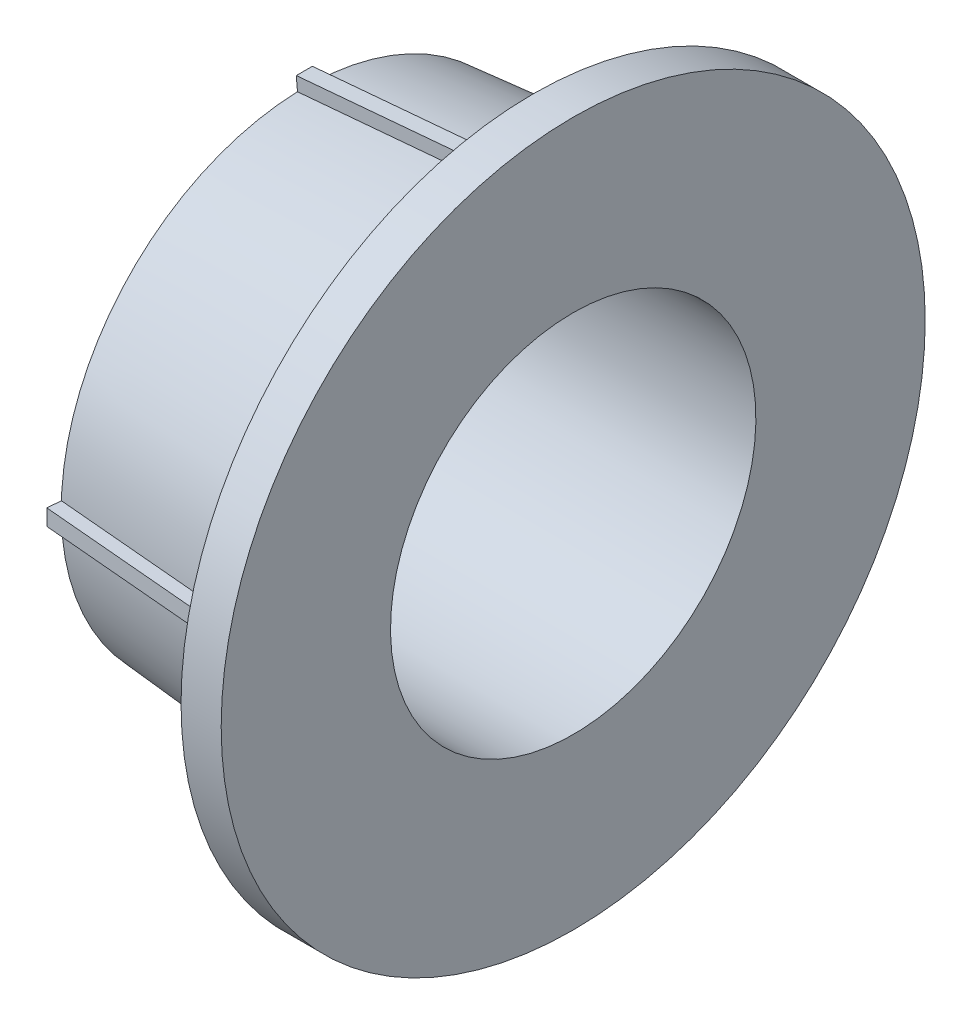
ISO-10303-21;
HEADER;
FILE_DESCRIPTION(('STEP AP214'),'2;1');
FILE_NAME('part.step','',(''),(''),'','','');
FILE_SCHEMA(('AUTOMOTIVE_DESIGN { 1 0 10303 214 1 1 1 1 }'));
ENDSEC;
DATA;
#1=APPLICATION_CONTEXT('core data for automotive mechanical design processes');
#2=APPLICATION_PROTOCOL_DEFINITION('international standard','automotive_design',2000,#1);
#3=PRODUCT_CONTEXT('',#1,'mechanical');
#4=PRODUCT('Part','Part','',(#3));
#5=PRODUCT_RELATED_PRODUCT_CATEGORY('part','',(#4));
#6=PRODUCT_DEFINITION_FORMATION('','',#4);
#7=PRODUCT_DEFINITION_CONTEXT('part definition',#1,'design');
#8=PRODUCT_DEFINITION('design','',#6,#7);
#9=PRODUCT_DEFINITION_SHAPE('','',#8);
#10=(LENGTH_UNIT() NAMED_UNIT(*) SI_UNIT(.MILLI.,.METRE.));
#11=(NAMED_UNIT(*) PLANE_ANGLE_UNIT() SI_UNIT($,.RADIAN.));
#12=(NAMED_UNIT(*) SI_UNIT($,.STERADIAN.) SOLID_ANGLE_UNIT());
#13=UNCERTAINTY_MEASURE_WITH_UNIT(LENGTH_MEASURE(1.E-05),#10,'distance_accuracy_value','');
#14=(GEOMETRIC_REPRESENTATION_CONTEXT(3) GLOBAL_UNCERTAINTY_ASSIGNED_CONTEXT((#13)) GLOBAL_UNIT_ASSIGNED_CONTEXT((#10,
#11,#12)) REPRESENTATION_CONTEXT('',''));
#15=CARTESIAN_POINT('',(0.,0.,0.));
#16=DIRECTION('',(0.,0.,1.));
#17=DIRECTION('',(1.,0.,0.));
#18=AXIS2_PLACEMENT_3D('',#15,#16,#17);
#19=CARTESIAN_POINT('',(-0.088023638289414,48.9361509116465,-0.600000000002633));
#20=DIRECTION('',(0.0871669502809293,-0.996193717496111,0.));
#21=DIRECTION('',(0.996193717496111,0.0871669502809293,0.));
#22=AXIS2_PLACEMENT_3D('',#19,#20,#21);
#23=PLANE('',#22);
#24=DIRECTION('',(0.,0.,1.));
#25=VECTOR('',#24,1.);
#26=CARTESIAN_POINT('',(-0.0880236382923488,48.9361509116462,-0.600000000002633));
#27=LINE('',#26,#25);
#28=CARTESIAN_POINT('',(-0.0880236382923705,48.9361509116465,0.600000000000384));
#29=VERTEX_POINT('',#28);
#30=CARTESIAN_POINT('',(-0.0880236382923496,48.9361509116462,-0.599999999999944));
#31=VERTEX_POINT('',#30);
#32=EDGE_CURVE('E514',#29,#31,#27,.F.);
#33=ORIENTED_EDGE('',*,*,#32,.F.);
#34=DIRECTION('',(0.996193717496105,0.0871669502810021,0.));
#35=VECTOR('',#34,1.);
#36=CARTESIAN_POINT('',(-0.0880236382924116,48.9361509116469,0.600000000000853));
#37=LINE('',#36,#35);
#38=CARTESIAN_POINT('',(16.9128330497,50.4237258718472,0.600000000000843));
#39=VERTEX_POINT('',#38);
#40=EDGE_CURVE('E169',#29,#39,#37,.T.);
#41=ORIENTED_EDGE('',*,*,#40,.T.);
#42=DIRECTION('',(0.,0.,1.));
#43=VECTOR('',#42,1.);
#44=CARTESIAN_POINT('',(16.9128330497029,50.4237258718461,-0.600000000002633));
#45=LINE('',#44,#43);
#46=CARTESIAN_POINT('',(16.9128330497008,50.4237258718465,-0.599999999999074));
#47=VERTEX_POINT('',#46);
#48=EDGE_CURVE('E140',#47,#39,#45,.T.);
#49=ORIENTED_EDGE('',*,*,#48,.F.);
#50=DIRECTION('',(-0.996193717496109,-0.0871669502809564,0.));
#51=VECTOR('',#50,1.);
#52=CARTESIAN_POINT('',(16.9128330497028,50.4237258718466,-0.599999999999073));
#53=LINE('',#52,#51);
#54=EDGE_CURVE('E155',#47,#31,#53,.T.);
#55=ORIENTED_EDGE('',*,*,#54,.T.);
#56=EDGE_LOOP('',(#33,#41,#49,#55));
#57=FACE_BOUND('',#56,.T.);
#58=ADVANCED_FACE('F16',(#57),#23,.F.);
#59=CARTESIAN_POINT('',(-0.0831186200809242,30.2900321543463,-19.2465479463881));
#60=DIRECTION('',(-0.0871669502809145,0.,-0.996193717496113));
#61=DIRECTION('',(-0.996193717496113,0.,0.0871669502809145));
#62=AXIS2_PLACEMENT_3D('',#59,#60,#61);
#63=PLANE('',#62);
#64=DIRECTION('',(-0.996193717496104,0.,0.0871669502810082));
#65=VECTOR('',#64,1.);
#66=CARTESIAN_POINT('',(16.9128330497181,29.090032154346,-20.7336937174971));
#67=LINE('',#66,#65);
#68=CARTESIAN_POINT('',(16.9128330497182,29.090032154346,-20.7336937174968));
#69=VERTEX_POINT('',#68);
#70=CARTESIAN_POINT('',(-0.0831186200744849,29.0900321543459,-19.2465479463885));
#71=VERTEX_POINT('',#70);
#72=EDGE_CURVE('E415',#69,#71,#67,.T.);
#73=ORIENTED_EDGE('',*,*,#72,.T.);
#74=DIRECTION('',(0.,1.,0.));
#75=VECTOR('',#74,1.);
#76=CARTESIAN_POINT('',(-0.0831186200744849,29.0900321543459,-19.2465479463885));
#77=LINE('',#76,#75);
#78=CARTESIAN_POINT('',(-0.0831186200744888,30.2900321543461,-19.2465479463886));
#79=VERTEX_POINT('',#78);
#80=EDGE_CURVE('E421',#71,#79,#77,.T.);
#81=ORIENTED_EDGE('',*,*,#80,.T.);
#82=DIRECTION('',(0.9961937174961,0.,-0.0871669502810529));
#83=VECTOR('',#82,1.);
#84=CARTESIAN_POINT('',(-0.0831186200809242,30.2900321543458,-19.2465479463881));
#85=LINE('',#84,#83);
#86=CARTESIAN_POINT('',(16.9128330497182,30.290032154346,-20.7336937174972));
#87=VERTEX_POINT('',#86);
#88=EDGE_CURVE('E430',#79,#87,#85,.T.);
#89=ORIENTED_EDGE('',*,*,#88,.T.);
#90=DIRECTION('',(0.,1.,0.));
#91=VECTOR('',#90,1.);
#92=CARTESIAN_POINT('',(16.9128330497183,30.2900321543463,-20.7336937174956));
#93=LINE('',#92,#91);
#94=EDGE_CURVE('E486',#87,#69,#93,.F.);
#95=ORIENTED_EDGE('',*,*,#94,.T.);
#96=EDGE_LOOP('',(#73,#81,#89,#95));
#97=FACE_BOUND('',#96,.T.);
#98=ADVANCED_FACE('F558',(#97),#63,.T.);
#99=CARTESIAN_POINT('',(-0.0831186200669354,10.4434842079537,-0.600000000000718));
#100=DIRECTION('',(-0.087166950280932,-0.996193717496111,0.));
#101=DIRECTION('',(0.996193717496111,-0.087166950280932,0.));
#102=AXIS2_PLACEMENT_3D('',#99,#100,#101);
#103=PLANE('',#102);
#104=DIRECTION('',(-0.996193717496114,0.0871669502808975,0.));
#105=VECTOR('',#104,1.);
#106=CARTESIAN_POINT('',(16.912833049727,8.95633843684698,0.599999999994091));
#107=LINE('',#106,#105);
#108=CARTESIAN_POINT('',(16.9128330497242,8.95633843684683,0.599999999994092));
#109=VERTEX_POINT('',#108);
#110=CARTESIAN_POINT('',(-0.0831186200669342,10.4434842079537,0.599999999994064));
#111=VERTEX_POINT('',#110);
#112=EDGE_CURVE('E386',#109,#111,#107,.T.);
#113=ORIENTED_EDGE('',*,*,#112,.T.);
#114=DIRECTION('',(0.,0.,1.));
#115=VECTOR('',#114,1.);
#116=CARTESIAN_POINT('',(-0.0831186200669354,10.4434842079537,0.599999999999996));
#117=LINE('',#116,#115);
#118=CARTESIAN_POINT('',(-0.0831186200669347,10.4434842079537,-0.600000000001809));
#119=VERTEX_POINT('',#118);
#120=EDGE_CURVE('E392',#111,#119,#117,.F.);
#121=ORIENTED_EDGE('',*,*,#120,.T.);
#122=DIRECTION('',(0.996193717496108,-0.0871669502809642,0.));
#123=VECTOR('',#122,1.);
#124=CARTESIAN_POINT('',(-0.0831186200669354,10.4434842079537,-0.600000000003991));
#125=LINE('',#124,#123);
#126=CARTESIAN_POINT('',(16.9128330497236,8.95633843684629,-0.600000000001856));
#127=VERTEX_POINT('',#126);
#128=EDGE_CURVE('E404',#119,#127,#125,.T.);
#129=ORIENTED_EDGE('',*,*,#128,.T.);
#130=DIRECTION('',(0.,0.,1.));
#131=VECTOR('',#130,1.);
#132=CARTESIAN_POINT('',(16.9128330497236,8.95633843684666,-0.600000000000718));
#133=LINE('',#132,#131);
#134=EDGE_CURVE('E465',#127,#109,#133,.T.);
#135=ORIENTED_EDGE('',*,*,#134,.T.);
#136=EDGE_LOOP('',(#113,#121,#129,#135));
#137=FACE_BOUND('',#136,.T.);
#138=ADVANCED_FACE('F635',(#137),#103,.T.);
#139=CARTESIAN_POINT('',(-0.0831186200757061,29.0900321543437,19.2465479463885));
#140=DIRECTION('',(-0.0871669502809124,0.,0.996193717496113));
#141=DIRECTION('',(0.996193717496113,0.,0.0871669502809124));
#142=AXIS2_PLACEMENT_3D('',#139,#140,#141);
#143=PLANE('',#142);
#144=DIRECTION('',(-0.996193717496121,0.,-0.0871669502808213));
#145=VECTOR('',#144,1.);
#146=CARTESIAN_POINT('',(16.9128330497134,30.2900321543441,20.7336937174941));
#147=LINE('',#146,#145);
#148=CARTESIAN_POINT('',(16.9128330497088,30.2900321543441,20.7336937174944));
#149=VERTEX_POINT('',#148);
#150=CARTESIAN_POINT('',(-0.0831186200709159,30.290032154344,19.2465479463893));
#151=VERTEX_POINT('',#150);
#152=EDGE_CURVE('E436',#149,#151,#147,.T.);
#153=ORIENTED_EDGE('',*,*,#152,.T.);
#154=DIRECTION('',(0.,1.,0.));
#155=VECTOR('',#154,1.);
#156=CARTESIAN_POINT('',(-0.0831186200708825,29.0900321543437,19.246547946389));
#157=LINE('',#156,#155);
#158=CARTESIAN_POINT('',(-0.0831186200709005,29.0900321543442,19.2465479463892));
#159=VERTEX_POINT('',#158);
#160=EDGE_CURVE('E447',#151,#159,#157,.F.);
#161=ORIENTED_EDGE('',*,*,#160,.T.);
#162=DIRECTION('',(0.996193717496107,0.,0.0871669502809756));
#163=VECTOR('',#162,1.);
#164=CARTESIAN_POINT('',(-0.0831186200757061,29.0900321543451,19.2465479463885));
#165=LINE('',#164,#163);
#166=CARTESIAN_POINT('',(16.9128330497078,29.0900321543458,20.7336937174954));
#167=VERTEX_POINT('',#166);
#168=EDGE_CURVE('E375',#159,#167,#165,.T.);
#169=ORIENTED_EDGE('',*,*,#168,.T.);
#170=DIRECTION('',(0.,1.,0.));
#171=VECTOR('',#170,1.);
#172=CARTESIAN_POINT('',(16.9128330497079,29.0900321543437,20.7336937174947));
#173=LINE('',#172,#171);
#174=EDGE_CURVE('E461',#167,#149,#173,.T.);
#175=ORIENTED_EDGE('',*,*,#174,.T.);
#176=EDGE_LOOP('',(#153,#161,#169,#175));
#177=FACE_BOUND('',#176,.T.);
#178=ADVANCED_FACE('F629',(#177),#143,.T.);
#179=CARTESIAN_POINT('',(16.9128330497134,30.2900321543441,20.7336937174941));
#180=DIRECTION('',(0.,-1.,0.));
#181=DIRECTION('',(0.,0.,-1.));
#182=AXIS2_PLACEMENT_3D('',#179,#180,#181);
#183=PLANE('',#182);
#184=CARTESIAN_POINT('',(0.00490499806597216,30.2900321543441,18.2405637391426));
#185=CARTESIAN_POINT('',(2.83741998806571,30.2900321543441,18.4885424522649));
#186=CARTESIAN_POINT('',(5.66993539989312,30.2900321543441,18.7365163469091));
#187=CARTESIAN_POINT('',(11.3349670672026,30.2900321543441,19.2324544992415));
#188=CARTESIAN_POINT('',(14.1674833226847,30.2900321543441,19.4804187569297));
#189=CARTESIAN_POINT('',(16.9999999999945,30.2900321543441,19.7283781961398));
#190=B_SPLINE_CURVE_WITH_KNOTS('',3,(#184,#185,#186,#187,#188,#189),.UNSPECIFIED.,.F.,.F.,(4,2,
4),(0.,8.53004756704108,17.0600951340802),.UNSPECIFIED.);
#191=CARTESIAN_POINT('',(0.00490499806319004,30.290032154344,18.2405637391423));
#192=VERTEX_POINT('',#191);
#193=CARTESIAN_POINT('',(16.9999999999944,30.2900321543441,19.7283781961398));
#194=VERTEX_POINT('',#193);
#195=EDGE_CURVE('E19',#192,#194,#190,.T.);
#196=ORIENTED_EDGE('',*,*,#195,.F.);
#197=DIRECTION('',(0.0871669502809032,0.,-0.996193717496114));
#198=VECTOR('',#197,1.);
#199=CARTESIAN_POINT('',(-0.0831186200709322,30.290032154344,19.2465479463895));
#200=LINE('',#199,#198);
#201=EDGE_CURVE('E352',#192,#151,#200,.F.);
#202=ORIENTED_EDGE('',*,*,#201,.T.);
#203=ORIENTED_EDGE('',*,*,#152,.F.);
#204=DIRECTION('',(-0.0871669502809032,0.,0.996193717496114));
#205=VECTOR('',#204,1.);
#206=CARTESIAN_POINT('',(16.9128330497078,30.2900321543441,20.7336937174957));
#207=LINE('',#206,#205);
#208=CARTESIAN_POINT('',(16.9999999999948,30.2900321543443,19.7375));
#209=VERTEX_POINT('',#208);
#210=EDGE_CURVE('E178',#149,#209,#207,.F.);
#211=ORIENTED_EDGE('',*,*,#210,.T.);
#212=DIRECTION('',(0.,0.,-1.));
#213=VECTOR('',#212,1.);
#214=CARTESIAN_POINT('',(16.9999999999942,30.2900321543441,20.7336937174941));
#215=LINE('',#214,#213);
#216=EDGE_CURVE('E96',#194,#209,#215,.F.);
#217=ORIENTED_EDGE('',*,*,#216,.F.);
#218=EDGE_LOOP('',(#196,#202,#203,#211,#217));
#219=FACE_BOUND('',#218,.T.);
#220=ADVANCED_FACE('F296',(#219),#183,.F.);
#221=CARTESIAN_POINT('',(16.9128330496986,50.4237258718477,0.600000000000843));
#222=DIRECTION('',(0.,0.,-1.));
#223=DIRECTION('',(0.,1.,0.));
#224=AXIS2_PLACEMENT_3D('',#221,#222,#223);
#225=PLANE('',#224);
#226=CARTESIAN_POINT('',(16.9999999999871,49.418410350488,0.600000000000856));
#227=CARTESIAN_POINT('',(14.1666658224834,49.1703793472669,0.600000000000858));
#228=CARTESIAN_POINT('',(11.3333320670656,48.922343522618,0.600000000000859));
#229=CARTESIAN_POINT('',(5.66666540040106,48.4262622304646,0.600000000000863));
#230=CARTESIAN_POINT('',(2.83333248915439,48.17821676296,0.600000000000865));
#231=CARTESIAN_POINT('',(-6.3742525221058E-12,47.9301664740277,0.600000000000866));
#232=B_SPLINE_CURVE_WITH_KNOTS('',3,(#226,#227,#228,#229,#230,#231),.UNSPECIFIED.,.F.,.F.,(4,2,
4),(0.,8.53250944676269,17.0650188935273),.UNSPECIFIED.);
#233=CARTESIAN_POINT('',(16.9999999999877,49.418410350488,0.600000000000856));
#234=VERTEX_POINT('',#233);
#235=CARTESIAN_POINT('',(-1.23703963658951E-12,47.930166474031,0.599999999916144));
#236=VERTEX_POINT('',#235);
#237=EDGE_CURVE('E153',#234,#236,#232,.T.);
#238=ORIENTED_EDGE('',*,*,#237,.F.);
#239=DIRECTION('',(0.,1.,0.));
#240=VECTOR('',#239,1.);
#241=CARTESIAN_POINT('',(16.9999999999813,50.4237258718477,0.600000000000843));
#242=LINE('',#241,#240);
#243=CARTESIAN_POINT('',(16.999999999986,49.427532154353,0.599999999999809));
#244=VERTEX_POINT('',#243);
#245=EDGE_CURVE('E145',#244,#234,#242,.F.);
#246=ORIENTED_EDGE('',*,*,#245,.F.);
#247=DIRECTION('',(0.0871669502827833,-0.996193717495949,0.));
#248=VECTOR('',#247,1.);
#249=CARTESIAN_POINT('',(16.9128330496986,50.4237258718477,0.600000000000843));
#250=LINE('',#249,#248);
#251=EDGE_CURVE('E149',#39,#244,#250,.T.);
#252=ORIENTED_EDGE('',*,*,#251,.F.);
#253=ORIENTED_EDGE('',*,*,#40,.F.);
#254=DIRECTION('',(-0.0871669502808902,0.996193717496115,0.));
#255=VECTOR('',#254,1.);
#256=CARTESIAN_POINT('',(-0.0880236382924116,48.9361509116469,0.599999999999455));
#257=LINE('',#256,#255);
#258=EDGE_CURVE('E351',#29,#236,#257,.F.);
#259=ORIENTED_EDGE('',*,*,#258,.T.);
#260=EDGE_LOOP('',(#238,#246,#252,#253,#259));
#261=FACE_BOUND('',#260,.T.);
#262=ADVANCED_FACE('F147',(#261),#225,.F.);
#263=CARTESIAN_POINT('',(16.9128330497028,50.4237258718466,-0.599999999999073));
#264=DIRECTION('',(0.,0.,1.));
#265=DIRECTION('',(0.,-1.,0.));
#266=AXIS2_PLACEMENT_3D('',#263,#264,#265);
#267=PLANE('',#266);
#268=CARTESIAN_POINT('',(-7.92163786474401E-12,47.9301664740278,-0.599999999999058));
#269=CARTESIAN_POINT('',(2.83333248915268,48.1782167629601,-0.59999999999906));
#270=CARTESIAN_POINT('',(5.66666540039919,48.4262622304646,-0.599999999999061));
#271=CARTESIAN_POINT('',(11.3333320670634,48.922343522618,-0.599999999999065));
#272=CARTESIAN_POINT('',(14.166665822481,49.1703793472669,-0.599999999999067));
#273=CARTESIAN_POINT('',(16.9999999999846,49.4184103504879,-0.599999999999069));
#274=B_SPLINE_CURVE_WITH_KNOTS('',3,(#268,#269,#270,#271,#272,#273),.UNSPECIFIED.,.F.,.F.,(4,2,
4),(0.,8.53250944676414,17.0650188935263),.UNSPECIFIED.);
#275=CARTESIAN_POINT('',(-1.75334308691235E-11,47.9301664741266,-0.599999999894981));
#276=VERTEX_POINT('',#275);
#277=CARTESIAN_POINT('',(16.9999999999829,49.4184103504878,-0.599999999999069));
#278=VERTEX_POINT('',#277);
#279=EDGE_CURVE('E276',#276,#278,#274,.T.);
#280=ORIENTED_EDGE('',*,*,#279,.F.);
#281=DIRECTION('',(-0.0871669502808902,0.996193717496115,0.));
#282=VECTOR('',#281,1.);
#283=CARTESIAN_POINT('',(-0.0880236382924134,48.9361509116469,-0.599999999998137));
#284=LINE('',#283,#282);
#285=EDGE_CURVE('E181',#276,#31,#284,.T.);
#286=ORIENTED_EDGE('',*,*,#285,.T.);
#287=ORIENTED_EDGE('',*,*,#54,.F.);
#288=DIRECTION('',(0.0871669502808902,-0.996193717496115,0.));
#289=VECTOR('',#288,1.);
#290=CARTESIAN_POINT('',(16.9128330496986,50.4237258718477,-0.599999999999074));
#291=LINE('',#290,#289);
#292=CARTESIAN_POINT('',(16.9999999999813,49.4275321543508,-0.599999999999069));
#293=VERTEX_POINT('',#292);
#294=EDGE_CURVE('E302',#47,#293,#291,.T.);
#295=ORIENTED_EDGE('',*,*,#294,.T.);
#296=DIRECTION('',(0.,-1.,0.));
#297=VECTOR('',#296,1.);
#298=CARTESIAN_POINT('',(16.9999999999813,50.4237258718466,-0.599999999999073));
#299=LINE('',#298,#297);
#300=EDGE_CURVE('E163',#278,#293,#299,.F.);
#301=ORIENTED_EDGE('',*,*,#300,.F.);
#302=EDGE_LOOP('',(#280,#286,#287,#295,#301));
#303=FACE_BOUND('',#302,.T.);
#304=ADVANCED_FACE('F288',(#303),#267,.F.);
#305=CARTESIAN_POINT('',(16.9128330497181,30.2900321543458,-20.733693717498));
#306=DIRECTION('',(0.,-1.,0.));
#307=DIRECTION('',(0.,0.,-1.));
#308=AXIS2_PLACEMENT_3D('',#305,#306,#307);
#309=PLANE('',#308);
#310=CARTESIAN_POINT('',(16.9999999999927,30.2900321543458,-19.7283781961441));
#311=CARTESIAN_POINT('',(14.1674833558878,30.2900321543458,-19.4804187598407));
#312=CARTESIAN_POINT('',(11.3349671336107,30.2900321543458,-19.2324545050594));
#313=CARTESIAN_POINT('',(5.66993553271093,30.2900321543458,-18.736516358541));
#314=CARTESIAN_POINT('',(2.83742015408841,30.2900321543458,-18.4885424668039));
#315=CARTESIAN_POINT('',(0.00490519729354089,30.2900321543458,-18.2405637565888));
#316=B_SPLINE_CURVE_WITH_KNOTS('',3,(#310,#311,#312,#313,#314,#315),.UNSPECIFIED.,.F.,.F.,(4,2,
4),(0.,8.53004746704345,17.0600949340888),.UNSPECIFIED.);
#317=CARTESIAN_POINT('',(16.9999999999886,30.2900321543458,-19.7283781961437));
#318=VERTEX_POINT('',#317);
#319=CARTESIAN_POINT('',(0.00490509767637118,30.2900321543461,-18.2405637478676));
#320=VERTEX_POINT('',#319);
#321=EDGE_CURVE('E267',#318,#320,#316,.T.);
#322=ORIENTED_EDGE('',*,*,#321,.F.);
#323=DIRECTION('',(0.,0.,-1.));
#324=VECTOR('',#323,1.);
#325=CARTESIAN_POINT('',(16.9999999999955,30.2900321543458,-20.733693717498));
#326=LINE('',#325,#324);
#327=CARTESIAN_POINT('',(16.9999999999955,30.2900321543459,-19.7375000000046));
#328=VERTEX_POINT('',#327);
#329=EDGE_CURVE('E424',#328,#318,#326,.F.);
#330=ORIENTED_EDGE('',*,*,#329,.F.);
#331=DIRECTION('',(0.0871669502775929,0.,0.996193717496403));
#332=VECTOR('',#331,1.);
#333=CARTESIAN_POINT('',(16.9128330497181,30.2900321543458,-20.733693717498));
#334=LINE('',#333,#332);
#335=EDGE_CURVE('E426',#87,#328,#334,.T.);
#336=ORIENTED_EDGE('',*,*,#335,.F.);
#337=ORIENTED_EDGE('',*,*,#88,.F.);
#338=DIRECTION('',(-0.0871669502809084,0.,-0.996193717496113));
#339=VECTOR('',#338,1.);
#340=CARTESIAN_POINT('',(-0.083118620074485,30.2900321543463,-19.2465479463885));
#341=LINE('',#340,#339);
#342=EDGE_CURVE('E418',#79,#320,#341,.F.);
#343=ORIENTED_EDGE('',*,*,#342,.T.);
#344=EDGE_LOOP('',(#322,#330,#336,#337,#343));
#345=FACE_BOUND('',#344,.T.);
#346=ADVANCED_FACE('F284',(#345),#309,.F.);
#347=CARTESIAN_POINT('',(-0.0831186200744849,29.0900321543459,-19.2465479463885));
#348=DIRECTION('',(0.996193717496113,0.,-0.0871669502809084));
#349=DIRECTION('',(-0.0871669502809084,0.,-0.996193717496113));
#350=AXIS2_PLACEMENT_3D('',#347,#348,#349);
#351=PLANE('',#350);
#352=CARTESIAN_POINT('',(1.61327496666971,29.6900321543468,0.140807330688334));
#353=DIRECTION('',(0.996193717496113,0.,-0.0871669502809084));
#354=DIRECTION('',(0.0871669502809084,0.,0.996193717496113));
#355=AXIS2_PLACEMENT_3D('',#352,#353,#354);
#356=ELLIPSE('',#355,18.4614309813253,18.3906225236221);
#357=CARTESIAN_POINT('',(0.00490499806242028,29.0900321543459,-18.2405637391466));
#358=VERTEX_POINT('',#357);
#359=EDGE_CURVE('E264',#320,#358,#356,.F.);
#360=ORIENTED_EDGE('',*,*,#359,.F.);
#361=ORIENTED_EDGE('',*,*,#342,.F.);
#362=ORIENTED_EDGE('',*,*,#80,.F.);
#363=DIRECTION('',(0.0871669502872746,0.,0.996193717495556));
#364=VECTOR('',#363,1.);
#365=CARTESIAN_POINT('',(-0.0831186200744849,29.0900321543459,-19.2465479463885));
#366=LINE('',#365,#364);
#367=EDGE_CURVE('E410',#71,#358,#366,.T.);
#368=ORIENTED_EDGE('',*,*,#367,.T.);
#369=EDGE_LOOP('',(#360,#361,#362,#368));
#370=FACE_BOUND('',#369,.T.);
#371=ADVANCED_FACE('F287',(#370),#351,.F.);
#372=CARTESIAN_POINT('',(16.9128330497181,29.090032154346,-20.7336937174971));
#373=DIRECTION('',(0.,1.,0.));
#374=DIRECTION('',(0.,0.,1.));
#375=AXIS2_PLACEMENT_3D('',#372,#373,#374);
#376=PLANE('',#375);
#377=CARTESIAN_POINT('',(0.00490499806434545,29.0900321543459,-18.2405637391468));
#378=CARTESIAN_POINT('',(2.83741998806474,29.0900321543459,-18.4885424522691));
#379=CARTESIAN_POINT('',(5.66993539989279,29.0900321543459,-18.7365163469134));
#380=CARTESIAN_POINT('',(11.3349670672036,29.0900321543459,-19.232454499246));
#381=CARTESIAN_POINT('',(14.1674833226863,29.0900321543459,-19.4804187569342));
#382=CARTESIAN_POINT('',(16.9999999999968,29.090032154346,-19.7283781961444));
#383=B_SPLINE_CURVE_WITH_KNOTS('',3,(#377,#378,#379,#380,#381,#382),.UNSPECIFIED.,.F.,.F.,(4,2,
4),(0.,8.53004756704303,17.0600951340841),.UNSPECIFIED.);
#384=CARTESIAN_POINT('',(16.9999999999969,29.0900321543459,-19.7283781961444));
#385=VERTEX_POINT('',#384);
#386=EDGE_CURVE('E258',#358,#385,#383,.T.);
#387=ORIENTED_EDGE('',*,*,#386,.F.);
#388=ORIENTED_EDGE('',*,*,#367,.F.);
#389=ORIENTED_EDGE('',*,*,#72,.F.);
#390=DIRECTION('',(0.0871669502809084,0.,0.996193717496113));
#391=VECTOR('',#390,1.);
#392=CARTESIAN_POINT('',(16.9128330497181,29.090032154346,-20.733693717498));
#393=LINE('',#392,#391);
#394=CARTESIAN_POINT('',(16.9999999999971,29.090032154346,-19.7375000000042));
#395=VERTEX_POINT('',#394);
#396=EDGE_CURVE('E275',#69,#395,#393,.T.);
#397=ORIENTED_EDGE('',*,*,#396,.T.);
#398=DIRECTION('',(0.,0.,1.));
#399=VECTOR('',#398,1.);
#400=CARTESIAN_POINT('',(16.9999999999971,29.090032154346,-20.7336937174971));
#401=LINE('',#400,#399);
#402=EDGE_CURVE('E407',#385,#395,#401,.F.);
#403=ORIENTED_EDGE('',*,*,#402,.F.);
#404=EDGE_LOOP('',(#387,#388,#389,#397,#403));
#405=FACE_BOUND('',#404,.T.);
#406=ADVANCED_FACE('F248',(#405),#376,.F.);
#407=CARTESIAN_POINT('',(16.9128330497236,8.95633843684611,-0.600000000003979));
#408=DIRECTION('',(0.,0.,1.));
#409=DIRECTION('',(0.,-1.,0.));
#410=AXIS2_PLACEMENT_3D('',#407,#408,#409);
#411=PLANE('',#410);
#412=CARTESIAN_POINT('',(16.9999999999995,9.96165395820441,-0.600000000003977));
#413=CARTESIAN_POINT('',(14.1674833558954,10.2096133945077,-0.600000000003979));
#414=CARTESIAN_POINT('',(11.3349671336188,10.4575776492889,-0.600000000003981));
#415=CARTESIAN_POINT('',(5.66993553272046,10.9535157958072,-0.600000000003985));
#416=CARTESIAN_POINT('',(2.83742015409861,11.2014896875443,-0.600000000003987));
#417=CARTESIAN_POINT('',(0.00490519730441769,11.4494683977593,-0.600000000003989));
#418=B_SPLINE_CURVE_WITH_KNOTS('',3,(#412,#413,#414,#415,#416,#417),.UNSPECIFIED.,.F.,.F.,(4,2,
4),(0.,8.53004746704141,17.0600949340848),.UNSPECIFIED.);
#419=CARTESIAN_POINT('',(16.9999999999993,9.96165395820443,-0.600000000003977));
#420=VERTEX_POINT('',#419);
#421=CARTESIAN_POINT('',(0.00490509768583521,11.4494684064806,-0.600000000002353));
#422=VERTEX_POINT('',#421);
#423=EDGE_CURVE('E252',#420,#422,#418,.T.);
#424=ORIENTED_EDGE('',*,*,#423,.F.);
#425=DIRECTION('',(0.,-1.,0.));
#426=VECTOR('',#425,1.);
#427=CARTESIAN_POINT('',(17.0000000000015,8.95633843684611,-0.600000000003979));
#428=LINE('',#427,#426);
#429=CARTESIAN_POINT('',(16.9999999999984,9.95253215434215,-0.600000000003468));
#430=VERTEX_POINT('',#429);
#431=EDGE_CURVE('E397',#430,#420,#428,.F.);
#432=ORIENTED_EDGE('',*,*,#431,.F.);
#433=DIRECTION('',(-0.0871669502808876,-0.996193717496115,0.));
#434=VECTOR('',#433,1.);
#435=CARTESIAN_POINT('',(16.9128330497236,8.95633843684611,-0.600000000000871));
#436=LINE('',#435,#434);
#437=EDGE_CURVE('E266',#430,#127,#436,.T.);
#438=ORIENTED_EDGE('',*,*,#437,.T.);
#439=ORIENTED_EDGE('',*,*,#128,.F.);
#440=DIRECTION('',(0.0871669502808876,0.996193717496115,0.));
#441=VECTOR('',#440,1.);
#442=CARTESIAN_POINT('',(-0.0831186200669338,10.4434842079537,-0.600000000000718));
#443=LINE('',#442,#441);
#444=EDGE_CURVE('E389',#119,#422,#443,.T.);
#445=ORIENTED_EDGE('',*,*,#444,.T.);
#446=EDGE_LOOP('',(#424,#432,#438,#439,#445));
#447=FACE_BOUND('',#446,.T.);
#448=ADVANCED_FACE('F243',(#447),#411,.F.);
#449=CARTESIAN_POINT('',(-0.0831186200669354,10.4434842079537,0.599999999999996));
#450=DIRECTION('',(0.996193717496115,-0.0871669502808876,0.));
#451=DIRECTION('',(0.0871669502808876,0.996193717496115,0.));
#452=AXIS2_PLACEMENT_3D('',#449,#450,#451);
#453=PLANE('',#452);
#454=CARTESIAN_POINT('',(0.00490499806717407,11.4494684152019,0.599999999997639));
#455=CARTESIAN_POINT('',(0.00476225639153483,11.4478368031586,0.550017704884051));
#456=CARTESIAN_POINT('',(0.00463735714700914,11.4464090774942,0.500028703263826));
#457=CARTESIAN_POINT('',(0.00442324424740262,11.4439614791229,0.400040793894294));
#458=CARTESIAN_POINT('',(0.00433403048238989,11.4429416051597,0.350041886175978));
#459=CARTESIAN_POINT('',(0.00419128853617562,11.4413097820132,0.250037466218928));
#460=CARTESIAN_POINT('',(0.00413776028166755,11.440697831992,0.200031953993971));
#461=CARTESIAN_POINT('',(0.00406638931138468,11.4398818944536,0.10001762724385));
#462=CARTESIAN_POINT('',(0.00404854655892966,11.4396779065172,0.0500088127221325));
#463=CARTESIAN_POINT('',(0.00404854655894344,11.4396779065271,-0.0500088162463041));
#464=CARTESIAN_POINT('',(0.00406638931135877,11.4398818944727,-0.100017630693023));
#465=CARTESIAN_POINT('',(0.00413776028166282,11.4406978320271,-0.200031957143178));
#466=CARTESIAN_POINT('',(0.00419128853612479,11.4413097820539,-0.250037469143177));
#467=CARTESIAN_POINT('',(0.00433403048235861,11.4429416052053,-0.350041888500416));
#468=CARTESIAN_POINT('',(0.00442324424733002,11.4439614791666,-0.400040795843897));
#469=CARTESIAN_POINT('',(0.00463735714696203,11.4464090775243,-0.500028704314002));
#470=CARTESIAN_POINT('',(0.00476225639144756,11.4478368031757,-0.550017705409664));
#471=CARTESIAN_POINT('',(0.00490499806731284,11.4494684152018,-0.59999999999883));
#472=B_SPLINE_CURVE_WITH_KNOTS('',3,(#454,#455,#456,#457,#458,#459,#460,#461,#462,#463,#464,
#465,#466,#467,#468,#469,#470,#471),.UNSPECIFIED.,.F.,.F.,(4,2,2,2,2,2,2,2,4),(0.,
0.150026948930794,0.300053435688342,0.450079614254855,0.600105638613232,0.750131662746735,
0.900157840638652,1.05018432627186,1.20021127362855),.UNSPECIFIED.);
#473=CARTESIAN_POINT('',(0.00490499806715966,11.4494684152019,0.599999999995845));
#474=VERTEX_POINT('',#473);
#475=EDGE_CURVE('E257',#422,#474,#472,.F.);
#476=ORIENTED_EDGE('',*,*,#475,.F.);
#477=ORIENTED_EDGE('',*,*,#444,.F.);
#478=ORIENTED_EDGE('',*,*,#120,.F.);
#479=DIRECTION('',(0.087166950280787,0.996193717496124,0.));
#480=VECTOR('',#479,1.);
#481=CARTESIAN_POINT('',(-0.0831186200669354,10.4434842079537,0.599999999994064));
#482=LINE('',#481,#480);
#483=EDGE_CURVE('E381',#111,#474,#482,.T.);
#484=ORIENTED_EDGE('',*,*,#483,.T.);
#485=EDGE_LOOP('',(#476,#477,#478,#484));
#486=FACE_BOUND('',#485,.T.);
#487=ADVANCED_FACE('F239',(#486),#453,.F.);
#488=CARTESIAN_POINT('',(16.912833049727,8.95633843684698,0.599999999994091));
#489=DIRECTION('',(0.,0.,-1.));
#490=DIRECTION('',(0.,1.,0.));
#491=AXIS2_PLACEMENT_3D('',#488,#489,#490);
#492=PLANE('',#491);
#493=CARTESIAN_POINT('',(0.00490499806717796,11.4494684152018,0.599999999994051));
#494=CARTESIAN_POINT('',(2.83741998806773,11.2014897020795,0.599999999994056));
#495=CARTESIAN_POINT('',(5.66993539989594,10.9535158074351,0.59999999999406));
#496=CARTESIAN_POINT('',(11.3349670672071,10.4575776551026,0.599999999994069));
#497=CARTESIAN_POINT('',(14.16748332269,10.2096133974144,0.599999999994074));
#498=CARTESIAN_POINT('',(17.0000000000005,9.96165395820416,0.599999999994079));
#499=B_SPLINE_CURVE_WITH_KNOTS('',3,(#493,#494,#495,#496,#497,#498),.UNSPECIFIED.,.F.,.F.,(4,2,
4),(0.,8.53004756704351,17.0600951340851),.UNSPECIFIED.);
#500=CARTESIAN_POINT('',(17.0000000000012,9.9616539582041,0.599999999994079));
#501=VERTEX_POINT('',#500);
#502=EDGE_CURVE('E218',#474,#501,#499,.T.);
#503=ORIENTED_EDGE('',*,*,#502,.F.);
#504=ORIENTED_EDGE('',*,*,#483,.F.);
#505=ORIENTED_EDGE('',*,*,#112,.F.);
#506=DIRECTION('',(-0.0871669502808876,-0.996193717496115,0.));
#507=VECTOR('',#506,1.);
#508=CARTESIAN_POINT('',(16.9128330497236,8.95633843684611,0.599999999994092));
#509=LINE('',#508,#507);
#510=CARTESIAN_POINT('',(17.0000000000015,9.95253215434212,0.599999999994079));
#511=VERTEX_POINT('',#510);
#512=EDGE_CURVE('E468',#109,#511,#509,.F.);
#513=ORIENTED_EDGE('',*,*,#512,.T.);
#514=DIRECTION('',(0.,1.,0.));
#515=VECTOR('',#514,1.);
#516=CARTESIAN_POINT('',(17.0000000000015,8.95633843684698,0.599999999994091));
#517=LINE('',#516,#515);
#518=EDGE_CURVE('E378',#501,#511,#517,.F.);
#519=ORIENTED_EDGE('',*,*,#518,.F.);
#520=EDGE_LOOP('',(#503,#504,#505,#513,#519));
#521=FACE_BOUND('',#520,.T.);
#522=ADVANCED_FACE('F233',(#521),#492,.F.);
#523=CARTESIAN_POINT('',(16.9128330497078,29.0900321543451,20.7336937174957));
#524=DIRECTION('',(0.,1.,0.));
#525=DIRECTION('',(0.,0.,1.));
#526=AXIS2_PLACEMENT_3D('',#523,#524,#525);
#527=PLANE('',#526);
#528=CARTESIAN_POINT('',(16.9999999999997,29.0900321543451,19.7283781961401));
#529=CARTESIAN_POINT('',(14.167483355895,29.0900321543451,19.4804187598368));
#530=CARTESIAN_POINT('',(11.334967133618,29.0900321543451,19.2324545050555));
#531=CARTESIAN_POINT('',(5.66993553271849,29.0900321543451,18.7365163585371));
#532=CARTESIAN_POINT('',(2.83742015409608,29.0900321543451,18.4885424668));
#533=CARTESIAN_POINT('',(0.0049051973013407,29.0900321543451,18.240563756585));
#534=B_SPLINE_CURVE_WITH_KNOTS('',3,(#528,#529,#530,#531,#532,#533),.UNSPECIFIED.,.F.,.F.,(4,2,
4),(0.,8.53004746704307,17.0600949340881),.UNSPECIFIED.);
#535=CARTESIAN_POINT('',(17.0000000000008,29.0900321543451,19.7283781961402));
#536=VERTEX_POINT('',#535);
#537=CARTESIAN_POINT('',(0.00490509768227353,29.0900321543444,18.2405637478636));
#538=VERTEX_POINT('',#537);
#539=EDGE_CURVE('E211',#536,#538,#534,.T.);
#540=ORIENTED_EDGE('',*,*,#539,.F.);
#541=DIRECTION('',(0.,0.,1.));
#542=VECTOR('',#541,1.);
#543=CARTESIAN_POINT('',(17.,29.0900321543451,20.7336937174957));
#544=LINE('',#543,#542);
#545=CARTESIAN_POINT('',(17.,29.0900321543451,19.7375000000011));
#546=VERTEX_POINT('',#545);
#547=EDGE_CURVE('E39',#546,#536,#544,.F.);
#548=ORIENTED_EDGE('',*,*,#547,.F.);
#549=DIRECTION('',(-0.0871669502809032,0.,0.996193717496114));
#550=VECTOR('',#549,1.);
#551=CARTESIAN_POINT('',(16.9128330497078,29.0900321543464,20.7336937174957));
#552=LINE('',#551,#550);
#553=EDGE_CURVE('E180',#546,#167,#552,.T.);
#554=ORIENTED_EDGE('',*,*,#553,.T.);
#555=ORIENTED_EDGE('',*,*,#168,.F.);
#556=DIRECTION('',(0.0871669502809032,0.,-0.996193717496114));
#557=VECTOR('',#556,1.);
#558=CARTESIAN_POINT('',(-0.0831186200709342,29.0900321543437,19.2465479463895));
#559=LINE('',#558,#557);
#560=EDGE_CURVE('E367',#159,#538,#559,.T.);
#561=ORIENTED_EDGE('',*,*,#560,.T.);
#562=EDGE_LOOP('',(#540,#548,#554,#555,#561));
#563=FACE_BOUND('',#562,.T.);
#564=ADVANCED_FACE('F228',(#563),#527,.F.);
#565=CARTESIAN_POINT('',(-0.0831186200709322,30.2900321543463,19.2465479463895));
#566=DIRECTION('',(0.996193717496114,0.,0.0871669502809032));
#567=DIRECTION('',(0.0871669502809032,0.,-0.996193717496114));
#568=AXIS2_PLACEMENT_3D('',#565,#566,#567);
#569=PLANE('',#568);
#570=ORIENTED_EDGE('',*,*,#201,.F.);
#571=CARTESIAN_POINT('',(1.61327496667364,29.6900321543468,-0.140807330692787));
#572=DIRECTION('',(0.996193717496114,0.,0.0871669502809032));
#573=DIRECTION('',(0.0871669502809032,0.,-0.996193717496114));
#574=AXIS2_PLACEMENT_3D('',#571,#572,#573);
#575=ELLIPSE('',#574,18.4614309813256,18.3906225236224);
#576=EDGE_CURVE('E208',#538,#192,#575,.F.);
#577=ORIENTED_EDGE('',*,*,#576,.F.);
#578=ORIENTED_EDGE('',*,*,#560,.F.);
#579=ORIENTED_EDGE('',*,*,#160,.F.);
#580=EDGE_LOOP('',(#570,#577,#578,#579));
#581=FACE_BOUND('',#580,.T.);
#582=ADVANCED_FACE('F232',(#581),#569,.F.);
#583=CARTESIAN_POINT('',(-0.0880236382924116,48.9361509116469,0.599999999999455));
#584=DIRECTION('',(0.996193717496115,0.0871669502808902,0.));
#585=DIRECTION('',(-0.0871669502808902,0.996193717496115,0.));
#586=AXIS2_PLACEMENT_3D('',#583,#584,#585);
#587=PLANE('',#586);
#588=DIRECTION('',(0.,0.,1.));
#589=VECTOR('',#588,1.);
#590=CARTESIAN_POINT('',(-1.74047007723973E-11,47.9301664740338,1.04083408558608E-13));
#591=LINE('',#590,#589);
#592=EDGE_CURVE('E207',#276,#236,#591,.T.);
#593=ORIENTED_EDGE('',*,*,#592,.T.);
#594=ORIENTED_EDGE('',*,*,#258,.F.);
#595=ORIENTED_EDGE('',*,*,#32,.T.);
#596=ORIENTED_EDGE('',*,*,#285,.F.);
#597=EDGE_LOOP('',(#593,#594,#595,#596));
#598=FACE_BOUND('',#597,.T.);
#599=ADVANCED_FACE('F308',(#598),#587,.F.);
#600=CARTESIAN_POINT('',(16.9128330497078,29.0900321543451,20.7336937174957));
#601=DIRECTION('',(-0.996193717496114,0.,-0.0871669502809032));
#602=DIRECTION('',(-0.0871669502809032,0.,0.996193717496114));
#603=AXIS2_PLACEMENT_3D('',#600,#601,#602);
#604=PLANE('',#603);
#605=DIRECTION('',(0.,1.,0.));
#606=VECTOR('',#605,1.);
#607=CARTESIAN_POINT('',(16.9999999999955,29.6900321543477,19.7375000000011));
#608=LINE('',#607,#606);
#609=EDGE_CURVE('E203',#546,#209,#608,.T.);
#610=ORIENTED_EDGE('',*,*,#609,.T.);
#611=ORIENTED_EDGE('',*,*,#210,.F.);
#612=ORIENTED_EDGE('',*,*,#174,.F.);
#613=ORIENTED_EDGE('',*,*,#553,.F.);
#614=EDGE_LOOP('',(#610,#611,#612,#613));
#615=FACE_BOUND('',#614,.T.);
#616=ADVANCED_FACE('F305',(#615),#604,.F.);
#617=CARTESIAN_POINT('',(16.9128330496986,50.4237258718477,0.600000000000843));
#618=DIRECTION('',(-0.996193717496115,-0.0871669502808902,0.));
#619=DIRECTION('',(0.0871669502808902,-0.996193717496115,0.));
#620=AXIS2_PLACEMENT_3D('',#617,#618,#619);
#621=PLANE('',#620);
#622=DIRECTION('',(0.,0.,1.));
#623=VECTOR('',#622,1.);
#624=CARTESIAN_POINT('',(16.9999999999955,49.4275321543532,-4.01761957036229E-12));
#625=LINE('',#624,#623);
#626=EDGE_CURVE('E159',#244,#293,#625,.F.);
#627=ORIENTED_EDGE('',*,*,#626,.T.);
#628=ORIENTED_EDGE('',*,*,#294,.F.);
#629=ORIENTED_EDGE('',*,*,#48,.T.);
#630=ORIENTED_EDGE('',*,*,#251,.T.);
#631=EDGE_LOOP('',(#627,#628,#629,#630));
#632=FACE_BOUND('',#631,.T.);
#633=ADVANCED_FACE('F168',(#632),#621,.F.);
#634=CARTESIAN_POINT('',(16.9128330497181,30.2900321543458,-20.733693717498));
#635=DIRECTION('',(-0.996193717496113,0.,0.0871669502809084));
#636=DIRECTION('',(0.0871669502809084,0.,0.996193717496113));
#637=AXIS2_PLACEMENT_3D('',#634,#635,#636);
#638=PLANE('',#637);
#639=DIRECTION('',(0.,1.,0.));
#640=VECTOR('',#639,1.);
#641=CARTESIAN_POINT('',(16.9999999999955,29.6900321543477,-19.7375000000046));
#642=LINE('',#641,#640);
#643=EDGE_CURVE('E199',#328,#395,#642,.F.);
#644=ORIENTED_EDGE('',*,*,#643,.T.);
#645=ORIENTED_EDGE('',*,*,#396,.F.);
#646=ORIENTED_EDGE('',*,*,#94,.F.);
#647=ORIENTED_EDGE('',*,*,#335,.T.);
#648=EDGE_LOOP('',(#644,#645,#646,#647));
#649=FACE_BOUND('',#648,.T.);
#650=ADVANCED_FACE('F560',(#649),#638,.F.);
#651=CARTESIAN_POINT('',(16.9128330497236,8.95633843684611,-0.600000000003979));
#652=DIRECTION('',(-0.996193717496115,0.0871669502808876,0.));
#653=DIRECTION('',(-0.0871669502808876,-0.996193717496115,0.));
#654=AXIS2_PLACEMENT_3D('',#651,#652,#653);
#655=PLANE('',#654);
#656=DIRECTION('',(0.,0.,1.));
#657=VECTOR('',#656,1.);
#658=CARTESIAN_POINT('',(16.9999999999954,9.95253215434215,-4.01761957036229E-12));
#659=LINE('',#658,#657);
#660=EDGE_CURVE('E195',#430,#511,#659,.T.);
#661=ORIENTED_EDGE('',*,*,#660,.T.);
#662=ORIENTED_EDGE('',*,*,#512,.F.);
#663=ORIENTED_EDGE('',*,*,#134,.F.);
#664=ORIENTED_EDGE('',*,*,#437,.F.);
#665=EDGE_LOOP('',(#661,#662,#663,#664));
#666=FACE_BOUND('',#665,.T.);
#667=ADVANCED_FACE('F342',(#666),#655,.F.);
#668=CARTESIAN_POINT('',(17.0000000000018,29.6900321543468,-2.24646690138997E-12));
#669=DIRECTION('',(1.,0.,0.));
#670=DIRECTION('',(0.,1.,0.));
#671=AXIS2_PLACEMENT_3D('',#668,#669,#670);
#672=CONICAL_SURFACE('',#671,19.7375000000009,0.0872777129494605);
#673=ORIENTED_EDGE('',*,*,#539,.T.);
#674=ORIENTED_EDGE('',*,*,#576,.T.);
#675=ORIENTED_EDGE('',*,*,#195,.T.);
#676=CARTESIAN_POINT('',(16.9999999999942,29.6900321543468,-2.24646690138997E-12));
#677=DIRECTION('',(1.,0.,0.));
#678=DIRECTION('',(0.,1.,0.));
#679=AXIS2_PLACEMENT_3D('',#676,#677,#678);
#680=CIRCLE('',#679,19.7375000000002);
#681=EDGE_CURVE('E166',#194,#234,#680,.F.);
#682=ORIENTED_EDGE('',*,*,#681,.T.);
#683=ORIENTED_EDGE('',*,*,#237,.T.);
#684=CARTESIAN_POINT('',(-1.75588710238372E-11,29.6900321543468,-2.2255491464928E-12));
#685=DIRECTION('',(1.,0.,0.));
#686=DIRECTION('',(0.,1.,0.));
#687=AXIS2_PLACEMENT_3D('',#684,#685,#686);
#688=CIRCLE('',#687,18.2499999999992);
#689=EDGE_CURVE('E204',#236,#276,#688,.T.);
#690=ORIENTED_EDGE('',*,*,#689,.T.);
#691=ORIENTED_EDGE('',*,*,#279,.T.);
#692=CARTESIAN_POINT('',(16.9999999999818,29.6900321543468,-2.24646690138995E-12));
#693=DIRECTION('',(1.,0.,0.));
#694=DIRECTION('',(0.,1.,0.));
#695=AXIS2_PLACEMENT_3D('',#692,#693,#694);
#696=CIRCLE('',#695,19.7374999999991);
#697=EDGE_CURVE('E165',#278,#318,#696,.F.);
#698=ORIENTED_EDGE('',*,*,#697,.T.);
#699=ORIENTED_EDGE('',*,*,#321,.T.);
#700=ORIENTED_EDGE('',*,*,#359,.T.);
#701=ORIENTED_EDGE('',*,*,#386,.T.);
#702=CARTESIAN_POINT('',(16.9999999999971,29.6900321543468,-2.24646690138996E-12));
#703=DIRECTION('',(1.,0.,0.));
#704=DIRECTION('',(0.,1.,0.));
#705=AXIS2_PLACEMENT_3D('',#702,#703,#704);
#706=CIRCLE('',#705,19.7375000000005);
#707=EDGE_CURVE('E196',#385,#420,#706,.F.);
#708=ORIENTED_EDGE('',*,*,#707,.T.);
#709=ORIENTED_EDGE('',*,*,#423,.T.);
#710=ORIENTED_EDGE('',*,*,#475,.T.);
#711=ORIENTED_EDGE('',*,*,#502,.T.);
#712=CARTESIAN_POINT('',(17.0000000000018,29.6900321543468,-2.24646690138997E-12));
#713=DIRECTION('',(1.,0.,0.));
#714=DIRECTION('',(0.,1.,0.));
#715=AXIS2_PLACEMENT_3D('',#712,#713,#714);
#716=CIRCLE('',#715,19.7375000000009);
#717=EDGE_CURVE('E192',#501,#536,#716,.F.);
#718=ORIENTED_EDGE('',*,*,#717,.T.);
#719=EDGE_LOOP('',(#673,#674,#675,#682,#683,#690,#691,#698,#699,#700,#701,#708,#709,#710,#711,#718));
#720=FACE_BOUND('',#719,.T.);
#721=ADVANCED_FACE('F224',(#720),#672,.T.);
#722=CARTESIAN_POINT('',(-1.7430501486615E-11,29.6900321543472,1.04083408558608E-13));
#723=DIRECTION('',(1.,0.,0.));
#724=DIRECTION('',(0.,1.,0.));
#725=AXIS2_PLACEMENT_3D('',#722,#723,#724);
#726=PLANE('',#725);
#727=ORIENTED_EDGE('',*,*,#689,.F.);
#728=ORIENTED_EDGE('',*,*,#592,.F.);
#729=EDGE_LOOP('',(#727,#728));
#730=FACE_BOUND('',#729,.T.);
#731=CARTESIAN_POINT('',(-1.74165200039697E-11,29.6900321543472,1.04083408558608E-13));
#732=DIRECTION('',(1.,0.,0.));
#733=DIRECTION('',(0.,1.,0.));
#734=AXIS2_PLACEMENT_3D('',#731,#732,#733);
#735=CIRCLE('',#734,13.6500000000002);
#736=CARTESIAN_POINT('',(-1.73972120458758E-11,43.3400321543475,1.04083408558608E-13));
#737=VERTEX_POINT('',#736);
#738=EDGE_CURVE('E189',#737,#737,#735,.T.);
#739=ORIENTED_EDGE('',*,*,#738,.T.);
#740=EDGE_LOOP('',(#739));
#741=FACE_BOUND('',#740,.T.);
#742=ADVANCED_FACE('F336',(#730,#741),#726,.F.);
#743=CARTESIAN_POINT('',(16.9999999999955,29.6900321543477,-4.01761957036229E-12));
#744=DIRECTION('',(1.,0.,0.));
#745=DIRECTION('',(0.,1.,0.));
#746=AXIS2_PLACEMENT_3D('',#743,#744,#745);
#747=PLANE('',#746);
#748=ORIENTED_EDGE('',*,*,#717,.F.);
#749=ORIENTED_EDGE('',*,*,#518,.T.);
#750=ORIENTED_EDGE('',*,*,#660,.F.);
#751=ORIENTED_EDGE('',*,*,#431,.T.);
#752=ORIENTED_EDGE('',*,*,#707,.F.);
#753=ORIENTED_EDGE('',*,*,#402,.T.);
#754=ORIENTED_EDGE('',*,*,#643,.F.);
#755=ORIENTED_EDGE('',*,*,#329,.T.);
#756=ORIENTED_EDGE('',*,*,#697,.F.);
#757=ORIENTED_EDGE('',*,*,#300,.T.);
#758=ORIENTED_EDGE('',*,*,#626,.F.);
#759=ORIENTED_EDGE('',*,*,#245,.T.);
#760=ORIENTED_EDGE('',*,*,#681,.F.);
#761=ORIENTED_EDGE('',*,*,#216,.T.);
#762=ORIENTED_EDGE('',*,*,#609,.F.);
#763=ORIENTED_EDGE('',*,*,#547,.T.);
#764=EDGE_LOOP('',(#748,#749,#750,#751,#752,#753,#754,#755,#756,#757,#758,#759,#760,#761,#762,#763));
#765=FACE_BOUND('',#764,.T.);
#766=CARTESIAN_POINT('',(16.9999999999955,29.6900321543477,-4.01761957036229E-12));
#767=DIRECTION('',(1.,0.,0.));
#768=DIRECTION('',(0.,1.,0.));
#769=AXIS2_PLACEMENT_3D('',#766,#767,#768);
#770=CIRCLE('',#769,26.3000000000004);
#771=CARTESIAN_POINT('',(16.9999999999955,55.9900321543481,-4.01761957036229E-12));
#772=VERTEX_POINT('',#771);
#773=EDGE_CURVE('E186',#772,#772,#770,.T.);
#774=ORIENTED_EDGE('',*,*,#773,.F.);
#775=EDGE_LOOP('',(#774));
#776=FACE_BOUND('',#775,.T.);
#777=ADVANCED_FACE('F160',(#765,#776),#747,.F.);
#778=CARTESIAN_POINT('',(-1.7430501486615E-11,29.6900321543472,1.04083408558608E-13));
#779=DIRECTION('',(1.,0.,0.));
#780=DIRECTION('',(0.,1.,0.));
#781=AXIS2_PLACEMENT_3D('',#778,#779,#780);
#782=CYLINDRICAL_SURFACE('',#781,13.6500000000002);
#783=ORIENTED_EDGE('',*,*,#738,.F.);
#784=EDGE_LOOP('',(#783));
#785=FACE_BOUND('',#784,.T.);
#786=CARTESIAN_POINT('',(19.9999999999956,29.6900321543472,0.));
#787=DIRECTION('',(1.,0.,0.));
#788=DIRECTION('',(0.,1.,0.));
#789=AXIS2_PLACEMENT_3D('',#786,#787,#788);
#790=CIRCLE('',#789,13.6500000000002);
#791=CARTESIAN_POINT('',(19.9999999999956,43.3400321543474,0.));
#792=VERTEX_POINT('',#791);
#793=EDGE_CURVE('E30',#792,#792,#790,.T.);
#794=ORIENTED_EDGE('',*,*,#793,.T.);
#795=EDGE_LOOP('',(#794));
#796=FACE_BOUND('',#795,.T.);
#797=ADVANCED_FACE('F326',(#785,#796),#782,.F.);
#798=CARTESIAN_POINT('',(16.9999999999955,29.6900321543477,-4.01761957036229E-12));
#799=DIRECTION('',(1.,0.,0.));
#800=DIRECTION('',(0.,1.,0.));
#801=AXIS2_PLACEMENT_3D('',#798,#799,#800);
#802=CYLINDRICAL_SURFACE('',#801,26.3000000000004);
#803=CARTESIAN_POINT('',(19.9999999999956,29.6900321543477,-4.01915599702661E-12));
#804=DIRECTION('',(1.,0.,0.));
#805=DIRECTION('',(0.,1.,0.));
#806=AXIS2_PLACEMENT_3D('',#803,#804,#805);
#807=CIRCLE('',#806,26.3000000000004);
#808=CARTESIAN_POINT('',(19.9999999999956,55.9900321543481,-4.01915599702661E-12));
#809=VERTEX_POINT('',#808);
#810=EDGE_CURVE('E11',#809,#809,#807,.F.);
#811=ORIENTED_EDGE('',*,*,#810,.T.);
#812=EDGE_LOOP('',(#811));
#813=FACE_BOUND('',#812,.T.);
#814=ORIENTED_EDGE('',*,*,#773,.T.);
#815=EDGE_LOOP('',(#814));
#816=FACE_BOUND('',#815,.T.);
#817=ADVANCED_FACE('F320',(#813,#816),#802,.T.);
#818=CARTESIAN_POINT('',(19.9999999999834,49.6900321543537,8.81239525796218E-13));
#819=DIRECTION('',(-1.,0.,0.));
#820=DIRECTION('',(0.,-1.,0.));
#821=AXIS2_PLACEMENT_3D('',#818,#819,#820);
#822=PLANE('',#821);
#823=ORIENTED_EDGE('',*,*,#810,.F.);
#824=EDGE_LOOP('',(#823));
#825=FACE_BOUND('',#824,.T.);
#826=ORIENTED_EDGE('',*,*,#793,.F.);
#827=EDGE_LOOP('',(#826));
#828=FACE_BOUND('',#827,.T.);
#829=ADVANCED_FACE('F318',(#825,#828),#822,.F.);
#830=CLOSED_SHELL('',(#58,#98,#138,#178,#220,#262,#304,#346,#371,#406,#448,#487,#522,#564,#582,
#599,#616,#633,#650,#667,#721,#742,#777,#797,#817,#829));
#831=MANIFOLD_SOLID_BREP('B1',#830);
#832=ADVANCED_BREP_SHAPE_REPRESENTATION('',(#18,#831),#14);
#833=SHAPE_DEFINITION_REPRESENTATION(#9,#832);
ENDSEC;
END-ISO-10303-21;
